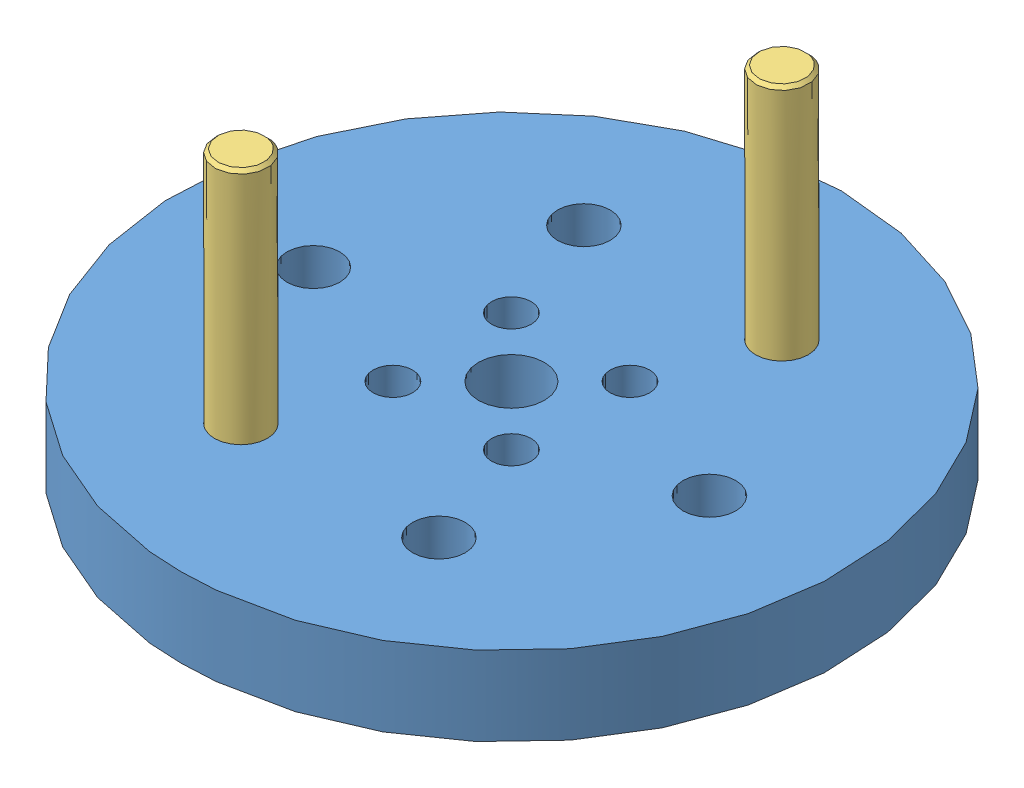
SolidWorks assembly rotor.SLDASM, configuration Default (file format 14000). Lengths in mm.
Overall size (50 29 50).
4 component instances, 3 part files, 8 mates.
Components (placement in the parent):
- rotor-base-1: rotor-base.SLDPRT [Default] at origin size (50 6 50)
- Pololu-1998-mounting-hub-1: Pololu-1998-mounting-hub.SLDPRT [Default] at (0 -5 0) x (0.707107 0 0.707107) z (0 1 0) size (19 19 5)
- generic-metric-dowel-pin-1: generic-metric-dowel-pin.SLDPRT [4 x 24] at (-7.5 12 12.9904) x (0 1 0) z (-0.367973 0 0.929836) size (24 4 4)
- generic-metric-dowel-pin-2: generic-metric-dowel-pin.SLDPRT [4 x 24] at (7.5 12 -12.9904) x (0 1 0) z (-0.367973 0 0.929836) size (24 4 4)
Mates (geometry in assembly coordinates):
- Coincident1: coordinate: point of rotor-base-1
- Coincident2: coincident anti-aligned: plane of rotor-base-1 through (0 0 0) normal (0 -1 0); plane of Pololu-1998-mounting-hub-1 through (0 0 0) normal (0 1 0)
- Concentric1: concentric aligned: cylinder of rotor-base-1 through (0 0 0) axis (0 1 0) radius 2.5; cylinder of Pololu-1998-mounting-hub-1 through (0 0 0) axis (0 1 0) radius 2.5
- Concentric3: concentric aligned: cylinder of rotor-base-1 through (4.4901 0 4.4901) axis (0 1 0) radius 1.5; cylinder of Pololu-1998-mounting-hub-1 through (4.4901 0 4.4901) axis (0 1 0) radius 1.25
- Concentric4: concentric anti-aligned: cylinder of rotor-base-1 through (-7.5 0 12.9904) axis (0 1 0) radius 2; cylinder of generic-metric-dowel-pin-1 through (-7.5 24 12.9904) axis (0 -1 0) radius 2
- Coincident3: coincident aligned: plane of rotor-base-1 through (0 0 0) normal (0 -1 0); plane of generic-metric-dowel-pin-1 through (-7.5 0 12.9904) normal (0 -1 0)
- Concentric5: concentric anti-aligned: cylinder of rotor-base-1 through (7.5 0 -12.9904) axis (0 1 0) radius 2; cylinder of generic-metric-dowel-pin-2 through (7.5 24 -12.9904) axis (0 -1 0) radius 2
- Coincident4: coincident aligned: plane of rotor-base-1 through (0 0 0) normal (0 -1 0); plane of generic-metric-dowel-pin-2 through (7.5 0 -12.9904) normal (0 -1 0)
